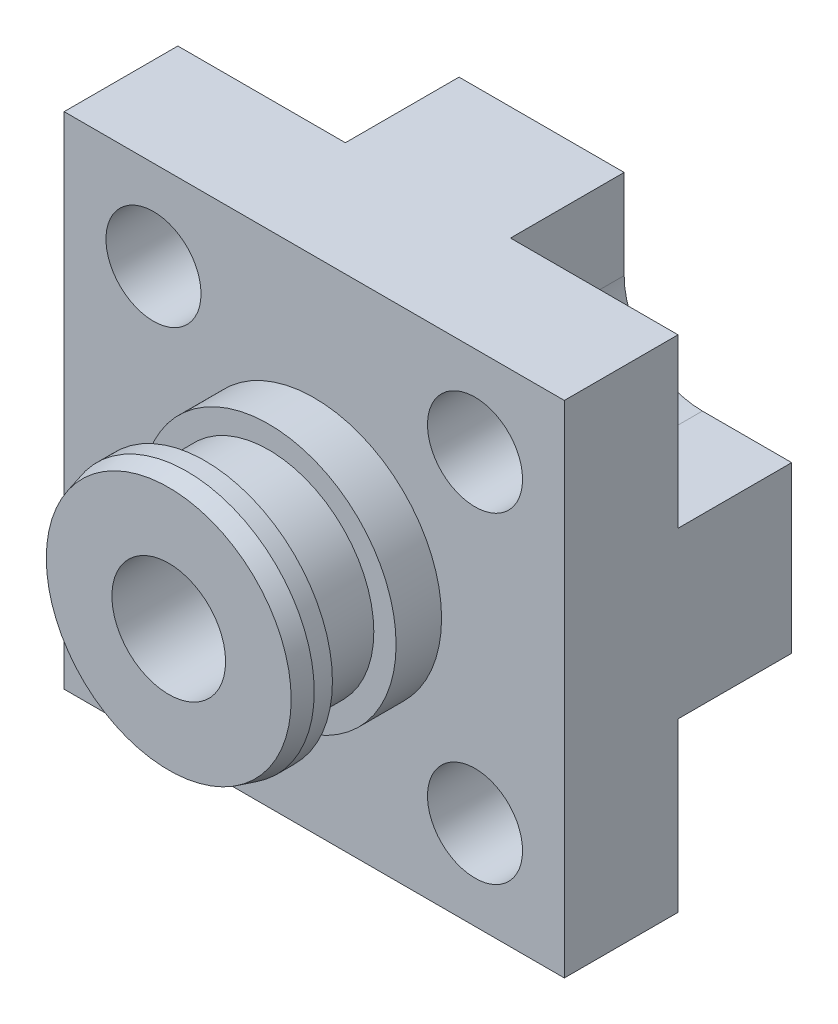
ISO-10303-21;
HEADER;
FILE_DESCRIPTION(('STEP AP214'),'2;1');
FILE_NAME('part.step','',(''),(''),'','','');
FILE_SCHEMA(('AUTOMOTIVE_DESIGN { 1 0 10303 214 1 1 1 1 }'));
ENDSEC;
DATA;
#1=APPLICATION_CONTEXT('core data for automotive mechanical design processes');
#2=APPLICATION_PROTOCOL_DEFINITION('international standard','automotive_design',2000,#1);
#3=PRODUCT_CONTEXT('',#1,'mechanical');
#4=PRODUCT('Part','Part','',(#3));
#5=PRODUCT_RELATED_PRODUCT_CATEGORY('part','',(#4));
#6=PRODUCT_DEFINITION_FORMATION('','',#4);
#7=PRODUCT_DEFINITION_CONTEXT('part definition',#1,'design');
#8=PRODUCT_DEFINITION('design','',#6,#7);
#9=PRODUCT_DEFINITION_SHAPE('','',#8);
#10=(LENGTH_UNIT() NAMED_UNIT(*) SI_UNIT(.MILLI.,.METRE.));
#11=(NAMED_UNIT(*) PLANE_ANGLE_UNIT() SI_UNIT($,.RADIAN.));
#12=(NAMED_UNIT(*) SI_UNIT($,.STERADIAN.) SOLID_ANGLE_UNIT());
#13=UNCERTAINTY_MEASURE_WITH_UNIT(LENGTH_MEASURE(1.E-05),#10,'distance_accuracy_value','');
#14=(GEOMETRIC_REPRESENTATION_CONTEXT(3) GLOBAL_UNCERTAINTY_ASSIGNED_CONTEXT((#13)) GLOBAL_UNIT_ASSIGNED_CONTEXT((#10,
#11,#12)) REPRESENTATION_CONTEXT('',''));
#15=CARTESIAN_POINT('',(0.,0.,0.));
#16=DIRECTION('',(0.,0.,1.));
#17=DIRECTION('',(1.,0.,0.));
#18=AXIS2_PLACEMENT_3D('',#15,#16,#17);
#19=CARTESIAN_POINT('',(8.98025612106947,-8.98025612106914,0.));
#20=DIRECTION('',(0.,0.,1.));
#21=DIRECTION('',(1.,0.,0.));
#22=AXIS2_PLACEMENT_3D('',#19,#20,#21);
#23=CYLINDRICAL_SURFACE('',#22,2.6543);
#24=CARTESIAN_POINT('',(8.98025612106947,-8.98025612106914,12.7));
#25=DIRECTION('',(0.,0.,1.));
#26=DIRECTION('',(1.,0.,0.));
#27=AXIS2_PLACEMENT_3D('',#24,#25,#26);
#28=CIRCLE('',#27,2.6543);
#29=CARTESIAN_POINT('',(11.6345561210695,-8.98025612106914,12.7));
#30=VERTEX_POINT('',#29);
#31=EDGE_CURVE('E321',#30,#30,#28,.T.);
#32=ORIENTED_EDGE('',*,*,#31,.T.);
#33=EDGE_LOOP('',(#32));
#34=FACE_BOUND('',#33,.T.);
#35=CARTESIAN_POINT('',(8.98025612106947,-8.98025612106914,6.35));
#36=DIRECTION('',(0.,0.,-1.));
#37=DIRECTION('',(-1.,0.,0.));
#38=AXIS2_PLACEMENT_3D('',#35,#36,#37);
#39=CIRCLE('',#38,2.6543);
#40=CARTESIAN_POINT('',(6.32595612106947,-8.98025612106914,6.35));
#41=VERTEX_POINT('',#40);
#42=EDGE_CURVE('E239',#41,#41,#39,.F.);
#43=ORIENTED_EDGE('',*,*,#42,.F.);
#44=EDGE_LOOP('',(#43));
#45=FACE_BOUND('',#44,.T.);
#46=ADVANCED_FACE('F34',(#34,#45),#23,.F.);
#47=CARTESIAN_POINT('',(-8.98025612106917,8.98025612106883,0.));
#48=DIRECTION('',(0.,0.,1.));
#49=DIRECTION('',(1.,0.,0.));
#50=AXIS2_PLACEMENT_3D('',#47,#48,#49);
#51=CYLINDRICAL_SURFACE('',#50,2.6543);
#52=CARTESIAN_POINT('',(-8.98025612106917,8.98025612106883,12.7));
#53=DIRECTION('',(0.,0.,1.));
#54=DIRECTION('',(1.,0.,0.));
#55=AXIS2_PLACEMENT_3D('',#52,#53,#54);
#56=CIRCLE('',#55,2.6543);
#57=CARTESIAN_POINT('',(-6.32595612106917,8.98025612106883,12.7));
#58=VERTEX_POINT('',#57);
#59=EDGE_CURVE('E315',#58,#58,#56,.T.);
#60=ORIENTED_EDGE('',*,*,#59,.T.);
#61=EDGE_LOOP('',(#60));
#62=FACE_BOUND('',#61,.T.);
#63=CARTESIAN_POINT('',(-8.98025612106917,8.98025612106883,6.35));
#64=DIRECTION('',(0.,0.,-1.));
#65=DIRECTION('',(-1.,0.,0.));
#66=AXIS2_PLACEMENT_3D('',#63,#64,#65);
#67=CIRCLE('',#66,2.6543);
#68=CARTESIAN_POINT('',(-11.6345561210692,8.98025612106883,6.35));
#69=VERTEX_POINT('',#68);
#70=EDGE_CURVE('E302',#69,#69,#67,.F.);
#71=ORIENTED_EDGE('',*,*,#70,.F.);
#72=EDGE_LOOP('',(#71));
#73=FACE_BOUND('',#72,.T.);
#74=ADVANCED_FACE('F409',(#62,#73),#51,.F.);
#75=CARTESIAN_POINT('',(0.,0.,15.24));
#76=DIRECTION('',(0.,0.,1.));
#77=DIRECTION('',(1.,0.,0.));
#78=AXIS2_PLACEMENT_3D('',#75,#76,#77);
#79=PLANE('',#78);
#80=CARTESIAN_POINT('',(0.,0.,15.24));
#81=DIRECTION('',(0.,0.,1.));
#82=DIRECTION('',(1.,0.,0.));
#83=AXIS2_PLACEMENT_3D('',#80,#81,#82);
#84=CIRCLE('',#83,7.112);
#85=CARTESIAN_POINT('',(7.112,0.,15.24));
#86=VERTEX_POINT('',#85);
#87=EDGE_CURVE('E346',#86,#86,#84,.T.);
#88=ORIENTED_EDGE('',*,*,#87,.T.);
#89=EDGE_LOOP('',(#88));
#90=FACE_BOUND('',#89,.T.);
#91=CARTESIAN_POINT('',(0.,0.,15.24));
#92=DIRECTION('',(0.,0.,1.));
#93=DIRECTION('',(1.,0.,0.));
#94=AXIS2_PLACEMENT_3D('',#91,#92,#93);
#95=CIRCLE('',#94,5.8674);
#96=CARTESIAN_POINT('',(5.8674,0.,15.24));
#97=VERTEX_POINT('',#96);
#98=EDGE_CURVE('E337',#97,#97,#95,.T.);
#99=ORIENTED_EDGE('',*,*,#98,.F.);
#100=EDGE_LOOP('',(#99));
#101=FACE_BOUND('',#100,.T.);
#102=ADVANCED_FACE('F415',(#90,#101),#79,.T.);
#103=CARTESIAN_POINT('',(13.97,-13.97,12.7));
#104=DIRECTION('',(0.,0.,1.));
#105=DIRECTION('',(1.,0.,0.));
#106=AXIS2_PLACEMENT_3D('',#103,#104,#105);
#107=PLANE('',#106);
#108=ORIENTED_EDGE('',*,*,#59,.F.);
#109=EDGE_LOOP('',(#108));
#110=FACE_BOUND('',#109,.T.);
#111=CARTESIAN_POINT('',(-8.98025612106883,-8.98025612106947,12.7));
#112=DIRECTION('',(0.,0.,1.));
#113=DIRECTION('',(1.,0.,0.));
#114=AXIS2_PLACEMENT_3D('',#111,#112,#113);
#115=CIRCLE('',#114,2.6543);
#116=CARTESIAN_POINT('',(-6.32595612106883,-8.98025612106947,12.7));
#117=VERTEX_POINT('',#116);
#118=EDGE_CURVE('E318',#117,#117,#115,.T.);
#119=ORIENTED_EDGE('',*,*,#118,.F.);
#120=EDGE_LOOP('',(#119));
#121=FACE_BOUND('',#120,.T.);
#122=ORIENTED_EDGE('',*,*,#31,.F.);
#123=EDGE_LOOP('',(#122));
#124=FACE_BOUND('',#123,.T.);
#125=CARTESIAN_POINT('',(8.98025612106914,8.98025612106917,12.7));
#126=DIRECTION('',(0.,0.,1.));
#127=DIRECTION('',(1.,0.,0.));
#128=AXIS2_PLACEMENT_3D('',#125,#126,#127);
#129=CIRCLE('',#128,2.6543);
#130=CARTESIAN_POINT('',(11.6345561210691,8.98025612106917,12.7));
#131=VERTEX_POINT('',#130);
#132=EDGE_CURVE('E324',#131,#131,#129,.T.);
#133=ORIENTED_EDGE('',*,*,#132,.F.);
#134=EDGE_LOOP('',(#133));
#135=FACE_BOUND('',#134,.T.);
#136=DIRECTION('',(0.,1.,0.));
#137=VECTOR('',#136,1.);
#138=CARTESIAN_POINT('',(13.97,13.97,12.7));
#139=LINE('',#138,#137);
#140=CARTESIAN_POINT('',(13.97,-13.97,12.7));
#141=VERTEX_POINT('',#140);
#142=CARTESIAN_POINT('',(13.97,13.97,12.7));
#143=VERTEX_POINT('',#142);
#144=EDGE_CURVE('E357',#141,#143,#139,.T.);
#145=ORIENTED_EDGE('',*,*,#144,.T.);
#146=DIRECTION('',(-1.,0.,0.));
#147=VECTOR('',#146,1.);
#148=CARTESIAN_POINT('',(-13.97,13.97,12.7));
#149=LINE('',#148,#147);
#150=CARTESIAN_POINT('',(-13.97,13.97,12.7));
#151=VERTEX_POINT('',#150);
#152=EDGE_CURVE('E360',#143,#151,#149,.T.);
#153=ORIENTED_EDGE('',*,*,#152,.T.);
#154=DIRECTION('',(0.,-1.,0.));
#155=VECTOR('',#154,1.);
#156=CARTESIAN_POINT('',(-13.97,13.97,12.7));
#157=LINE('',#156,#155);
#158=CARTESIAN_POINT('',(-13.97,-13.97,12.7));
#159=VERTEX_POINT('',#158);
#160=EDGE_CURVE('E362',#151,#159,#157,.T.);
#161=ORIENTED_EDGE('',*,*,#160,.T.);
#162=DIRECTION('',(1.,0.,0.));
#163=VECTOR('',#162,1.);
#164=CARTESIAN_POINT('',(-13.97,-13.97,12.7));
#165=LINE('',#164,#163);
#166=EDGE_CURVE('E364',#159,#141,#165,.T.);
#167=ORIENTED_EDGE('',*,*,#166,.T.);
#168=EDGE_LOOP('',(#145,#153,#161,#167));
#169=FACE_BOUND('',#168,.T.);
#170=CARTESIAN_POINT('',(0.,0.,12.7));
#171=DIRECTION('',(0.,0.,1.));
#172=DIRECTION('',(1.,0.,0.));
#173=AXIS2_PLACEMENT_3D('',#170,#171,#172);
#174=CIRCLE('',#173,7.112);
#175=CARTESIAN_POINT('',(7.112,0.,12.7));
#176=VERTEX_POINT('',#175);
#177=EDGE_CURVE('E343',#176,#176,#174,.T.);
#178=ORIENTED_EDGE('',*,*,#177,.F.);
#179=EDGE_LOOP('',(#178));
#180=FACE_BOUND('',#179,.T.);
#181=ADVANCED_FACE('F456',(#110,#121,#124,#135,#169,#180),#107,.T.);
#182=CARTESIAN_POINT('',(13.97,13.97,12.7));
#183=DIRECTION('',(-1.,0.,0.));
#184=DIRECTION('',(0.,0.,1.));
#185=AXIS2_PLACEMENT_3D('',#182,#183,#184);
#186=PLANE('',#185);
#187=DIRECTION('',(0.,-1.,0.));
#188=VECTOR('',#187,1.);
#189=CARTESIAN_POINT('',(13.97,13.97,6.35));
#190=LINE('',#189,#188);
#191=CARTESIAN_POINT('',(13.97,-4.61145612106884,6.35));
#192=VERTEX_POINT('',#191);
#193=CARTESIAN_POINT('',(13.97,-13.97,6.35));
#194=VERTEX_POINT('',#193);
#195=EDGE_CURVE('E243',#192,#194,#190,.T.);
#196=ORIENTED_EDGE('',*,*,#195,.F.);
#197=DIRECTION('',(0.,0.,-1.));
#198=VECTOR('',#197,1.);
#199=CARTESIAN_POINT('',(13.97,-4.61145612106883,12.7));
#200=LINE('',#199,#198);
#201=CARTESIAN_POINT('',(13.97,-4.61145612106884,0.));
#202=VERTEX_POINT('',#201);
#203=EDGE_CURVE('E245',#192,#202,#200,.T.);
#204=ORIENTED_EDGE('',*,*,#203,.T.);
#205=DIRECTION('',(0.,1.,0.));
#206=VECTOR('',#205,1.);
#207=CARTESIAN_POINT('',(13.97,13.97,0.));
#208=LINE('',#207,#206);
#209=CARTESIAN_POINT('',(13.97,4.61145612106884,0.));
#210=VERTEX_POINT('',#209);
#211=EDGE_CURVE('E349',#202,#210,#208,.T.);
#212=ORIENTED_EDGE('',*,*,#211,.T.);
#213=DIRECTION('',(0.,0.,1.));
#214=VECTOR('',#213,1.);
#215=CARTESIAN_POINT('',(13.97,4.61145612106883,12.7));
#216=LINE('',#215,#214);
#217=CARTESIAN_POINT('',(13.97,4.61145612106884,6.35));
#218=VERTEX_POINT('',#217);
#219=EDGE_CURVE('E281',#210,#218,#216,.T.);
#220=ORIENTED_EDGE('',*,*,#219,.T.);
#221=DIRECTION('',(0.,1.,0.));
#222=VECTOR('',#221,1.);
#223=CARTESIAN_POINT('',(13.97,13.97,6.35));
#224=LINE('',#223,#222);
#225=CARTESIAN_POINT('',(13.97,13.97,6.35));
#226=VERTEX_POINT('',#225);
#227=EDGE_CURVE('E275',#218,#226,#224,.T.);
#228=ORIENTED_EDGE('',*,*,#227,.T.);
#229=DIRECTION('',(0.,0.,-1.));
#230=VECTOR('',#229,1.);
#231=CARTESIAN_POINT('',(13.97,13.97,12.7));
#232=LINE('',#231,#230);
#233=EDGE_CURVE('E375',#143,#226,#232,.T.);
#234=ORIENTED_EDGE('',*,*,#233,.F.);
#235=ORIENTED_EDGE('',*,*,#144,.F.);
#236=DIRECTION('',(0.,0.,-1.));
#237=VECTOR('',#236,1.);
#238=CARTESIAN_POINT('',(13.97,-13.97,12.7));
#239=LINE('',#238,#237);
#240=EDGE_CURVE('E366',#141,#194,#239,.T.);
#241=ORIENTED_EDGE('',*,*,#240,.T.);
#242=EDGE_LOOP('',(#196,#204,#212,#220,#228,#234,#235,#241));
#243=FACE_BOUND('',#242,.T.);
#244=ADVANCED_FACE('F36',(#243),#186,.F.);
#245=CARTESIAN_POINT('',(-13.97,13.97,12.7));
#246=DIRECTION('',(0.,-1.,0.));
#247=DIRECTION('',(0.,0.,-1.));
#248=AXIS2_PLACEMENT_3D('',#245,#246,#247);
#249=PLANE('',#248);
#250=DIRECTION('',(-1.,0.,0.));
#251=VECTOR('',#250,1.);
#252=CARTESIAN_POINT('',(-13.97,13.97,6.35));
#253=LINE('',#252,#251);
#254=CARTESIAN_POINT('',(4.61145612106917,13.97,6.35));
#255=VERTEX_POINT('',#254);
#256=EDGE_CURVE('E272',#226,#255,#253,.T.);
#257=ORIENTED_EDGE('',*,*,#256,.T.);
#258=DIRECTION('',(0.,0.,-1.));
#259=VECTOR('',#258,1.);
#260=CARTESIAN_POINT('',(4.61145612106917,13.97,12.7));
#261=LINE('',#260,#259);
#262=CARTESIAN_POINT('',(4.61145612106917,13.97,0.));
#263=VERTEX_POINT('',#262);
#264=EDGE_CURVE('E278',#255,#263,#261,.T.);
#265=ORIENTED_EDGE('',*,*,#264,.T.);
#266=DIRECTION('',(-1.,0.,0.));
#267=VECTOR('',#266,1.);
#268=CARTESIAN_POINT('',(-13.97,13.97,0.));
#269=LINE('',#268,#267);
#270=CARTESIAN_POINT('',(-4.61145612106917,13.97,0.));
#271=VERTEX_POINT('',#270);
#272=EDGE_CURVE('E351',#263,#271,#269,.T.);
#273=ORIENTED_EDGE('',*,*,#272,.T.);
#274=DIRECTION('',(0.,0.,1.));
#275=VECTOR('',#274,1.);
#276=CARTESIAN_POINT('',(-4.61145612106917,13.97,12.7));
#277=LINE('',#276,#275);
#278=CARTESIAN_POINT('',(-4.61145612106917,13.97,6.35));
#279=VERTEX_POINT('',#278);
#280=EDGE_CURVE('E312',#271,#279,#277,.T.);
#281=ORIENTED_EDGE('',*,*,#280,.T.);
#282=DIRECTION('',(1.,0.,0.));
#283=VECTOR('',#282,1.);
#284=CARTESIAN_POINT('',(-13.97,13.97,6.35));
#285=LINE('',#284,#283);
#286=CARTESIAN_POINT('',(-13.97,13.97,6.35));
#287=VERTEX_POINT('',#286);
#288=EDGE_CURVE('E307',#287,#279,#285,.T.);
#289=ORIENTED_EDGE('',*,*,#288,.F.);
#290=DIRECTION('',(0.,0.,-1.));
#291=VECTOR('',#290,1.);
#292=CARTESIAN_POINT('',(-13.97,13.97,12.7));
#293=LINE('',#292,#291);
#294=EDGE_CURVE('E372',#151,#287,#293,.T.);
#295=ORIENTED_EDGE('',*,*,#294,.F.);
#296=ORIENTED_EDGE('',*,*,#152,.F.);
#297=ORIENTED_EDGE('',*,*,#233,.T.);
#298=EDGE_LOOP('',(#257,#265,#273,#281,#289,#295,#296,#297));
#299=FACE_BOUND('',#298,.T.);
#300=ADVANCED_FACE('F472',(#299),#249,.F.);
#301=CARTESIAN_POINT('',(-13.97,13.97,12.7));
#302=DIRECTION('',(1.,0.,0.));
#303=DIRECTION('',(0.,0.,-1.));
#304=AXIS2_PLACEMENT_3D('',#301,#302,#303);
#305=PLANE('',#304);
#306=DIRECTION('',(0.,-1.,0.));
#307=VECTOR('',#306,1.);
#308=CARTESIAN_POINT('',(-13.97,13.97,0.));
#309=LINE('',#308,#307);
#310=CARTESIAN_POINT('',(-13.97,4.61145612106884,0.));
#311=VERTEX_POINT('',#310);
#312=CARTESIAN_POINT('',(-13.97,-4.61145612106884,0.));
#313=VERTEX_POINT('',#312);
#314=EDGE_CURVE('E353',#311,#313,#309,.T.);
#315=ORIENTED_EDGE('',*,*,#314,.T.);
#316=DIRECTION('',(0.,0.,1.));
#317=VECTOR('',#316,1.);
#318=CARTESIAN_POINT('',(-13.97,-4.61145612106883,12.7));
#319=LINE('',#318,#317);
#320=CARTESIAN_POINT('',(-13.97,-4.61145612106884,6.35));
#321=VERTEX_POINT('',#320);
#322=EDGE_CURVE('E184',#313,#321,#319,.T.);
#323=ORIENTED_EDGE('',*,*,#322,.T.);
#324=DIRECTION('',(0.,-1.,0.));
#325=VECTOR('',#324,1.);
#326=CARTESIAN_POINT('',(-13.97,13.97,6.35));
#327=LINE('',#326,#325);
#328=CARTESIAN_POINT('',(-13.97,-13.97,6.35));
#329=VERTEX_POINT('',#328);
#330=EDGE_CURVE('E216',#321,#329,#327,.T.);
#331=ORIENTED_EDGE('',*,*,#330,.T.);
#332=DIRECTION('',(0.,0.,-1.));
#333=VECTOR('',#332,1.);
#334=CARTESIAN_POINT('',(-13.97,-13.97,12.7));
#335=LINE('',#334,#333);
#336=EDGE_CURVE('E369',#159,#329,#335,.T.);
#337=ORIENTED_EDGE('',*,*,#336,.F.);
#338=ORIENTED_EDGE('',*,*,#160,.F.);
#339=ORIENTED_EDGE('',*,*,#294,.T.);
#340=DIRECTION('',(0.,1.,0.));
#341=VECTOR('',#340,1.);
#342=CARTESIAN_POINT('',(-13.97,13.97,6.35));
#343=LINE('',#342,#341);
#344=CARTESIAN_POINT('',(-13.97,4.61145612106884,6.35));
#345=VERTEX_POINT('',#344);
#346=EDGE_CURVE('E305',#345,#287,#343,.T.);
#347=ORIENTED_EDGE('',*,*,#346,.F.);
#348=DIRECTION('',(0.,0.,-1.));
#349=VECTOR('',#348,1.);
#350=CARTESIAN_POINT('',(-13.97,4.61145612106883,12.7));
#351=LINE('',#350,#349);
#352=EDGE_CURVE('E309',#345,#311,#351,.T.);
#353=ORIENTED_EDGE('',*,*,#352,.T.);
#354=EDGE_LOOP('',(#315,#323,#331,#337,#338,#339,#347,#353));
#355=FACE_BOUND('',#354,.T.);
#356=ADVANCED_FACE('F469',(#355),#305,.F.);
#357=CARTESIAN_POINT('',(-13.97,-13.97,12.7));
#358=DIRECTION('',(0.,1.,0.));
#359=DIRECTION('',(0.,0.,1.));
#360=AXIS2_PLACEMENT_3D('',#357,#358,#359);
#361=PLANE('',#360);
#362=CARTESIAN_POINT('',(0.,-13.97,6.35));
#363=DIRECTION('',(0.,-1.,0.));
#364=DIRECTION('',(0.,0.,-1.));
#365=AXIS2_PLACEMENT_3D('',#362,#363,#364);
#366=CIRCLE('',#365,3.175);
#367=CARTESIAN_POINT('',(0.,-13.97,3.175));
#368=VERTEX_POINT('',#367);
#369=EDGE_CURVE('E327',#368,#368,#366,.T.);
#370=ORIENTED_EDGE('',*,*,#369,.F.);
#371=EDGE_LOOP('',(#370));
#372=FACE_BOUND('',#371,.T.);
#373=DIRECTION('',(1.,0.,0.));
#374=VECTOR('',#373,1.);
#375=CARTESIAN_POINT('',(-13.97,-13.97,6.35));
#376=LINE('',#375,#374);
#377=CARTESIAN_POINT('',(-4.61145612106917,-13.97,6.35));
#378=VERTEX_POINT('',#377);
#379=EDGE_CURVE('E213',#329,#378,#376,.T.);
#380=ORIENTED_EDGE('',*,*,#379,.T.);
#381=DIRECTION('',(0.,0.,-1.));
#382=VECTOR('',#381,1.);
#383=CARTESIAN_POINT('',(-4.61145612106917,-13.97,12.7));
#384=LINE('',#383,#382);
#385=CARTESIAN_POINT('',(-4.61145612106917,-13.97,0.));
#386=VERTEX_POINT('',#385);
#387=EDGE_CURVE('E219',#378,#386,#384,.T.);
#388=ORIENTED_EDGE('',*,*,#387,.T.);
#389=DIRECTION('',(1.,0.,0.));
#390=VECTOR('',#389,1.);
#391=CARTESIAN_POINT('',(-13.97,-13.97,0.));
#392=LINE('',#391,#390);
#393=CARTESIAN_POINT('',(4.61145612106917,-13.97,0.));
#394=VERTEX_POINT('',#393);
#395=EDGE_CURVE('E355',#386,#394,#392,.T.);
#396=ORIENTED_EDGE('',*,*,#395,.T.);
#397=DIRECTION('',(0.,0.,1.));
#398=VECTOR('',#397,1.);
#399=CARTESIAN_POINT('',(4.61145612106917,-13.97,12.7));
#400=LINE('',#399,#398);
#401=CARTESIAN_POINT('',(4.61145612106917,-13.97,6.35));
#402=VERTEX_POINT('',#401);
#403=EDGE_CURVE('E248',#394,#402,#400,.T.);
#404=ORIENTED_EDGE('',*,*,#403,.T.);
#405=DIRECTION('',(-1.,0.,0.));
#406=VECTOR('',#405,1.);
#407=CARTESIAN_POINT('',(-13.97,-13.97,6.35));
#408=LINE('',#407,#406);
#409=EDGE_CURVE('E241',#194,#402,#408,.T.);
#410=ORIENTED_EDGE('',*,*,#409,.F.);
#411=ORIENTED_EDGE('',*,*,#240,.F.);
#412=ORIENTED_EDGE('',*,*,#166,.F.);
#413=ORIENTED_EDGE('',*,*,#336,.T.);
#414=EDGE_LOOP('',(#380,#388,#396,#404,#410,#411,#412,#413));
#415=FACE_BOUND('',#414,.T.);
#416=ADVANCED_FACE('F463',(#372,#415),#361,.F.);
#417=CARTESIAN_POINT('',(13.97,-13.97,0.));
#418=DIRECTION('',(0.,0.,1.));
#419=DIRECTION('',(1.,0.,0.));
#420=AXIS2_PLACEMENT_3D('',#417,#418,#419);
#421=PLANE('',#420);
#422=CARTESIAN_POINT('',(-8.98025612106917,-8.98025612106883,0.));
#423=DIRECTION('',(0.,0.,-1.));
#424=DIRECTION('',(1.,0.,0.));
#425=AXIS2_PLACEMENT_3D('',#422,#423,#424);
#426=CIRCLE('',#425,4.3688);
#427=CARTESIAN_POINT('',(-8.98025612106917,-4.61145612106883,0.));
#428=VERTEX_POINT('',#427);
#429=CARTESIAN_POINT('',(-4.61145612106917,-8.98025612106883,0.));
#430=VERTEX_POINT('',#429);
#431=EDGE_CURVE('E54',#428,#430,#426,.T.);
#432=ORIENTED_EDGE('',*,*,#431,.F.);
#433=DIRECTION('',(1.,0.,0.));
#434=VECTOR('',#433,1.);
#435=CARTESIAN_POINT('',(-8.98025612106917,-4.61145612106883,0.));
#436=LINE('',#435,#434);
#437=EDGE_CURVE('E178',#313,#428,#436,.T.);
#438=ORIENTED_EDGE('',*,*,#437,.F.);
#439=ORIENTED_EDGE('',*,*,#314,.F.);
#440=DIRECTION('',(-1.,0.,0.));
#441=VECTOR('',#440,1.);
#442=CARTESIAN_POINT('',(-8.98025612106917,4.61145612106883,0.));
#443=LINE('',#442,#441);
#444=CARTESIAN_POINT('',(-8.98025612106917,4.61145612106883,0.));
#445=VERTEX_POINT('',#444);
#446=EDGE_CURVE('E286',#445,#311,#443,.T.);
#447=ORIENTED_EDGE('',*,*,#446,.F.);
#448=CARTESIAN_POINT('',(-8.98025612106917,8.98025612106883,0.));
#449=DIRECTION('',(0.,0.,-1.));
#450=DIRECTION('',(-1.,0.,0.));
#451=AXIS2_PLACEMENT_3D('',#448,#449,#450);
#452=CIRCLE('',#451,4.3688);
#453=CARTESIAN_POINT('',(-4.61145612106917,8.98025612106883,0.));
#454=VERTEX_POINT('',#453);
#455=EDGE_CURVE('E284',#454,#445,#452,.T.);
#456=ORIENTED_EDGE('',*,*,#455,.F.);
#457=DIRECTION('',(0.,-1.,0.));
#458=VECTOR('',#457,1.);
#459=CARTESIAN_POINT('',(-4.61145612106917,8.98025612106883,0.));
#460=LINE('',#459,#458);
#461=EDGE_CURVE('E288',#271,#454,#460,.T.);
#462=ORIENTED_EDGE('',*,*,#461,.F.);
#463=ORIENTED_EDGE('',*,*,#272,.F.);
#464=DIRECTION('',(0.,1.,0.));
#465=VECTOR('',#464,1.);
#466=CARTESIAN_POINT('',(4.61145612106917,8.98025612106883,0.));
#467=LINE('',#466,#465);
#468=CARTESIAN_POINT('',(4.61145612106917,8.98025612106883,0.));
#469=VERTEX_POINT('',#468);
#470=EDGE_CURVE('E253',#469,#263,#467,.T.);
#471=ORIENTED_EDGE('',*,*,#470,.F.);
#472=CARTESIAN_POINT('',(8.98025612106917,8.98025612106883,0.));
#473=DIRECTION('',(0.,0.,-1.));
#474=DIRECTION('',(1.,0.,0.));
#475=AXIS2_PLACEMENT_3D('',#472,#473,#474);
#476=CIRCLE('',#475,4.3688);
#477=CARTESIAN_POINT('',(8.98025612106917,4.61145612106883,0.));
#478=VERTEX_POINT('',#477);
#479=EDGE_CURVE('E251',#478,#469,#476,.T.);
#480=ORIENTED_EDGE('',*,*,#479,.F.);
#481=DIRECTION('',(-1.,0.,0.));
#482=VECTOR('',#481,1.);
#483=CARTESIAN_POINT('',(8.98025612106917,4.61145612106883,0.));
#484=LINE('',#483,#482);
#485=EDGE_CURVE('E255',#210,#478,#484,.T.);
#486=ORIENTED_EDGE('',*,*,#485,.F.);
#487=ORIENTED_EDGE('',*,*,#211,.F.);
#488=DIRECTION('',(1.,0.,0.));
#489=VECTOR('',#488,1.);
#490=CARTESIAN_POINT('',(8.98025612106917,-4.61145612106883,0.));
#491=LINE('',#490,#489);
#492=CARTESIAN_POINT('',(8.98025612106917,-4.61145612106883,0.));
#493=VERTEX_POINT('',#492);
#494=EDGE_CURVE('E224',#493,#202,#491,.T.);
#495=ORIENTED_EDGE('',*,*,#494,.F.);
#496=CARTESIAN_POINT('',(8.98025612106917,-8.98025612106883,0.));
#497=DIRECTION('',(0.,0.,-1.));
#498=DIRECTION('',(-1.,0.,0.));
#499=AXIS2_PLACEMENT_3D('',#496,#497,#498);
#500=CIRCLE('',#499,4.3688);
#501=CARTESIAN_POINT('',(4.61145612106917,-8.98025612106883,0.));
#502=VERTEX_POINT('',#501);
#503=EDGE_CURVE('E62',#502,#493,#500,.T.);
#504=ORIENTED_EDGE('',*,*,#503,.F.);
#505=DIRECTION('',(0.,1.,0.));
#506=VECTOR('',#505,1.);
#507=CARTESIAN_POINT('',(4.61145612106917,-8.98025612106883,0.));
#508=LINE('',#507,#506);
#509=EDGE_CURVE('E226',#394,#502,#508,.T.);
#510=ORIENTED_EDGE('',*,*,#509,.F.);
#511=ORIENTED_EDGE('',*,*,#395,.F.);
#512=DIRECTION('',(0.,-1.,0.));
#513=VECTOR('',#512,1.);
#514=CARTESIAN_POINT('',(-4.61145612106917,-8.98025612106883,0.));
#515=LINE('',#514,#513);
#516=EDGE_CURVE('E189',#430,#386,#515,.T.);
#517=ORIENTED_EDGE('',*,*,#516,.F.);
#518=EDGE_LOOP('',(#432,#438,#439,#447,#456,#462,#463,#471,#480,#486,#487,#495,#504,#510,#511,#517));
#519=FACE_BOUND('',#518,.T.);
#520=ADVANCED_FACE('F197',(#519),#421,.F.);
#521=CARTESIAN_POINT('',(0.,0.,15.24));
#522=DIRECTION('',(0.,0.,-1.));
#523=DIRECTION('',(-1.,0.,0.));
#524=AXIS2_PLACEMENT_3D('',#521,#522,#523);
#525=CYLINDRICAL_SURFACE('',#524,7.112);
#526=ORIENTED_EDGE('',*,*,#87,.F.);
#527=EDGE_LOOP('',(#526));
#528=FACE_BOUND('',#527,.T.);
#529=ORIENTED_EDGE('',*,*,#177,.T.);
#530=EDGE_LOOP('',(#529));
#531=FACE_BOUND('',#530,.T.);
#532=ADVANCED_FACE('F452',(#528,#531),#525,.T.);
#533=CARTESIAN_POINT('',(0.,0.,18.796));
#534=DIRECTION('',(0.,0.,-1.));
#535=DIRECTION('',(-1.,0.,0.));
#536=AXIS2_PLACEMENT_3D('',#533,#534,#535);
#537=CYLINDRICAL_SURFACE('',#536,5.8674);
#538=CARTESIAN_POINT('',(0.,0.,18.796));
#539=DIRECTION('',(0.,0.,1.));
#540=DIRECTION('',(1.,0.,0.));
#541=AXIS2_PLACEMENT_3D('',#538,#539,#540);
#542=CIRCLE('',#541,5.8674);
#543=CARTESIAN_POINT('',(5.8674,0.,18.796));
#544=VERTEX_POINT('',#543);
#545=EDGE_CURVE('E340',#544,#544,#542,.T.);
#546=ORIENTED_EDGE('',*,*,#545,.F.);
#547=EDGE_LOOP('',(#546));
#548=FACE_BOUND('',#547,.T.);
#549=ORIENTED_EDGE('',*,*,#98,.T.);
#550=EDGE_LOOP('',(#549));
#551=FACE_BOUND('',#550,.T.);
#552=ADVANCED_FACE('F442',(#548,#551),#537,.T.);
#553=CARTESIAN_POINT('',(0.,0.,18.796));
#554=DIRECTION('',(0.,0.,1.));
#555=DIRECTION('',(1.,0.,0.));
#556=AXIS2_PLACEMENT_3D('',#553,#554,#555);
#557=PLANE('',#556);
#558=CARTESIAN_POINT('',(0.,0.,18.796));
#559=DIRECTION('',(0.,0.,1.));
#560=DIRECTION('',(1.,0.,0.));
#561=AXIS2_PLACEMENT_3D('',#558,#559,#560);
#562=CIRCLE('',#561,7.112);
#563=CARTESIAN_POINT('',(7.112,0.,18.796));
#564=VERTEX_POINT('',#563);
#565=EDGE_CURVE('E334',#564,#564,#562,.T.);
#566=ORIENTED_EDGE('',*,*,#565,.F.);
#567=EDGE_LOOP('',(#566));
#568=FACE_BOUND('',#567,.T.);
#569=ORIENTED_EDGE('',*,*,#545,.T.);
#570=EDGE_LOOP('',(#569));
#571=FACE_BOUND('',#570,.T.);
#572=ADVANCED_FACE('F438',(#568,#571),#557,.F.);
#573=CARTESIAN_POINT('',(0.,0.,20.828));
#574=DIRECTION('',(0.,0.,-1.));
#575=DIRECTION('',(-1.,0.,0.));
#576=AXIS2_PLACEMENT_3D('',#573,#574,#575);
#577=CYLINDRICAL_SURFACE('',#576,7.112);
#578=CARTESIAN_POINT('',(0.,0.,19.812));
#579=DIRECTION('',(0.,0.,1.));
#580=DIRECTION('',(1.,0.,0.));
#581=AXIS2_PLACEMENT_3D('',#578,#579,#580);
#582=CIRCLE('',#581,7.112);
#583=CARTESIAN_POINT('',(7.112,0.,19.812));
#584=VERTEX_POINT('',#583);
#585=EDGE_CURVE('E11',#584,#584,#582,.F.);
#586=ORIENTED_EDGE('',*,*,#585,.T.);
#587=EDGE_LOOP('',(#586));
#588=FACE_BOUND('',#587,.T.);
#589=ORIENTED_EDGE('',*,*,#565,.T.);
#590=EDGE_LOOP('',(#589));
#591=FACE_BOUND('',#590,.T.);
#592=ADVANCED_FACE('F441',(#588,#591),#577,.T.);
#593=CARTESIAN_POINT('',(0.,0.,20.828));
#594=DIRECTION('',(0.,0.,1.));
#595=DIRECTION('',(1.,0.,0.));
#596=AXIS2_PLACEMENT_3D('',#593,#594,#595);
#597=PLANE('',#596);
#598=CARTESIAN_POINT('',(0.,0.,20.828));
#599=DIRECTION('',(0.,0.,1.));
#600=DIRECTION('',(1.,0.,0.));
#601=AXIS2_PLACEMENT_3D('',#598,#599,#600);
#602=CIRCLE('',#601,3.175);
#603=CARTESIAN_POINT('',(3.175,0.,20.828));
#604=VERTEX_POINT('',#603);
#605=EDGE_CURVE('E655',#604,#604,#602,.T.);
#606=ORIENTED_EDGE('',*,*,#605,.F.);
#607=EDGE_LOOP('',(#606));
#608=FACE_BOUND('',#607,.T.);
#609=CARTESIAN_POINT('',(0.,0.,20.828));
#610=DIRECTION('',(0.,0.,1.));
#611=DIRECTION('',(1.,0.,0.));
#612=AXIS2_PLACEMENT_3D('',#609,#610,#611);
#613=CIRCLE('',#612,6.83976362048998);
#614=CARTESIAN_POINT('',(6.83976362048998,0.,20.828));
#615=VERTEX_POINT('',#614);
#616=EDGE_CURVE('E47',#615,#615,#613,.T.);
#617=ORIENTED_EDGE('',*,*,#616,.T.);
#618=EDGE_LOOP('',(#617));
#619=FACE_BOUND('',#618,.T.);
#620=ADVANCED_FACE('F391',(#608,#619),#597,.T.);
#621=CARTESIAN_POINT('',(0.,-7.62,6.35));
#622=DIRECTION('',(0.,-1.,0.));
#623=DIRECTION('',(0.,0.,-1.));
#624=AXIS2_PLACEMENT_3D('',#621,#622,#623);
#625=PLANE('',#624);
#626=CARTESIAN_POINT('',(0.,-7.62,6.35));
#627=DIRECTION('',(0.,-1.,0.));
#628=DIRECTION('',(0.,0.,-1.));
#629=AXIS2_PLACEMENT_3D('',#626,#627,#628);
#630=CIRCLE('',#629,3.175);
#631=CARTESIAN_POINT('',(0.,-7.62,3.175));
#632=VERTEX_POINT('',#631);
#633=EDGE_CURVE('E330',#632,#632,#630,.T.);
#634=ORIENTED_EDGE('',*,*,#633,.T.);
#635=EDGE_LOOP('',(#634));
#636=FACE_BOUND('',#635,.T.);
#637=CARTESIAN_POINT('',(0.,-7.62,6.35));
#638=DIRECTION('',(0.,-1.,0.));
#639=DIRECTION('',(0.,0.,-1.));
#640=AXIS2_PLACEMENT_3D('',#637,#638,#639);
#641=CIRCLE('',#640,2.38125);
#642=CARTESIAN_POINT('',(0.,-7.62,3.96875));
#643=VERTEX_POINT('',#642);
#644=EDGE_CURVE('E333',#643,#643,#641,.F.);
#645=ORIENTED_EDGE('',*,*,#644,.T.);
#646=EDGE_LOOP('',(#645));
#647=FACE_BOUND('',#646,.T.);
#648=ADVANCED_FACE('F427',(#636,#647),#625,.T.);
#649=CARTESIAN_POINT('',(0.,-7.62,6.35));
#650=DIRECTION('',(0.,-1.,0.));
#651=DIRECTION('',(0.,0.,-1.));
#652=AXIS2_PLACEMENT_3D('',#649,#650,#651);
#653=CYLINDRICAL_SURFACE('',#652,3.175);
#654=ORIENTED_EDGE('',*,*,#633,.F.);
#655=EDGE_LOOP('',(#654));
#656=FACE_BOUND('',#655,.T.);
#657=ORIENTED_EDGE('',*,*,#369,.T.);
#658=EDGE_LOOP('',(#657));
#659=FACE_BOUND('',#658,.T.);
#660=ADVANCED_FACE('F430',(#656,#659),#653,.F.);
#661=CARTESIAN_POINT('',(0.,1.27,6.35));
#662=DIRECTION('',(0.,-1.,0.));
#663=DIRECTION('',(0.,0.,-1.));
#664=AXIS2_PLACEMENT_3D('',#661,#662,#663);
#665=CYLINDRICAL_SURFACE('',#664,2.38125);
#666=CARTESIAN_POINT('',(0.,-3.175,3.96875));
#667=CARTESIAN_POINT('',(-0.11623774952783,-3.17499261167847,3.96875771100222));
#668=CARTESIAN_POINT('',(-0.23266564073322,-3.16854909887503,3.97733050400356));
#669=CARTESIAN_POINT('',(-0.461861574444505,-3.14335491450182,4.01108393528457));
#670=CARTESIAN_POINT('',(-0.57461966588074,-3.12457330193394,4.03630632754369));
#671=CARTESIAN_POINT('',(-0.792534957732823,-3.07650633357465,4.10164425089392));
#672=CARTESIAN_POINT('',(-0.897733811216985,-3.04728486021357,4.14166925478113));
#673=CARTESIAN_POINT('',(-1.0992204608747,-2.98054008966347,4.23472346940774));
#674=CARTESIAN_POINT('',(-1.19551085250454,-2.94301922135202,4.28774887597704));
#675=CARTESIAN_POINT('',(-1.38662717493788,-2.8582865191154,4.41049253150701));
#676=CARTESIAN_POINT('',(-1.48049175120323,-2.81049902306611,4.48130188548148));
#677=CARTESIAN_POINT('',(-1.65580562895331,-2.7109264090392,4.63469964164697));
#678=CARTESIAN_POINT('',(-1.737235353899,-2.65913517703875,4.71730622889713));
#679=CARTESIAN_POINT('',(-1.90241493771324,-2.54430408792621,4.91106293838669));
#680=CARTESIAN_POINT('',(-1.98327293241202,-2.48111732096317,5.02460208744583));
#681=CARTESIAN_POINT('',(-2.12505922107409,-2.3607941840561,5.26645348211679));
#682=CARTESIAN_POINT('',(-2.18601475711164,-2.30364961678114,5.39474520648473));
#683=CARTESIAN_POINT('',(-2.26822996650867,-2.2221373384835,5.61896075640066));
#684=CARTESIAN_POINT('',(-2.29593258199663,-2.1932543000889,5.71085773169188));
#685=CARTESIAN_POINT('',(-2.34030317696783,-2.14584905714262,5.89977346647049));
#686=CARTESIAN_POINT('',(-2.35699641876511,-2.12730314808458,5.99677994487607));
#687=CARTESIAN_POINT('',(-2.3782785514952,-2.10349718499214,6.19471485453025));
#688=CARTESIAN_POINT('',(-2.38275740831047,-2.09835792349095,6.29567068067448));
#689=CARTESIAN_POINT('',(-2.37884038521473,-2.10279506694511,6.49702617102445));
#690=CARTESIAN_POINT('',(-2.37043988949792,-2.11237674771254,6.59742562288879));
#691=CARTESIAN_POINT('',(-2.34311411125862,-2.14261101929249,6.78369126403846));
#692=CARTESIAN_POINT('',(-2.32540947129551,-2.1619711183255,6.86996398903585));
#693=CARTESIAN_POINT('',(-2.28132752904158,-2.20843781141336,7.03808421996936));
#694=CARTESIAN_POINT('',(-2.25494189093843,-2.23555184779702,7.11992738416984));
#695=CARTESIAN_POINT('',(-2.17539989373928,-2.3136505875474,7.3283070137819));
#696=CARTESIAN_POINT('',(-2.11582235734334,-2.36895718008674,7.45077316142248));
#697=CARTESIAN_POINT('',(-1.97831112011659,-2.48496610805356,7.68222448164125));
#698=CARTESIAN_POINT('',(-1.90033281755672,-2.54568132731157,7.7911759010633));
#699=CARTESIAN_POINT('',(-1.72484421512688,-2.66782029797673,7.99743350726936));
#700=CARTESIAN_POINT('',(-1.62689183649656,-2.72922343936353,8.09437771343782));
#701=CARTESIAN_POINT('',(-1.41354575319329,-2.845562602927,8.27129353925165));
#702=CARTESIAN_POINT('',(-1.29818614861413,-2.90051090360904,8.35129762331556));
#703=CARTESIAN_POINT('',(-1.07616955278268,-2.98894065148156,8.47721951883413));
#704=CARTESIAN_POINT('',(-0.972407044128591,-3.02451723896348,8.52675554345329));
#705=CARTESIAN_POINT('',(-0.756209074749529,-3.0856698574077,8.61095699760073));
#706=CARTESIAN_POINT('',(-0.643779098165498,-3.11125215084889,8.64563174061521));
#707=CARTESIAN_POINT('',(-0.412236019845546,-3.1503237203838,8.6983147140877));
#708=CARTESIAN_POINT('',(-0.293086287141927,-3.1637381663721,8.71621983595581));
#709=CARTESIAN_POINT('',(-0.052706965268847,-3.17683965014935,8.73370998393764));
#710=CARTESIAN_POINT('',(0.0685217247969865,-3.1765324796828,8.73330273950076));
#711=CARTESIAN_POINT('',(0.296551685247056,-3.16297544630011,8.71519900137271));
#712=CARTESIAN_POINT('',(0.403577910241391,-3.15103015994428,8.69924517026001));
#713=CARTESIAN_POINT('',(0.612950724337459,-3.11707717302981,8.65350410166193));
#714=CARTESIAN_POINT('',(0.715296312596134,-3.09506733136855,8.62371392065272));
#715=CARTESIAN_POINT('',(0.916649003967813,-3.04164744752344,8.55045363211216));
#716=CARTESIAN_POINT('',(1.01541080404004,-3.00993306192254,8.50653782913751));
#717=CARTESIAN_POINT('',(1.20414866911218,-2.93952537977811,8.40712589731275));
#718=CARTESIAN_POINT('',(1.29412351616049,-2.90083111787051,8.3516281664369));
#719=CARTESIAN_POINT('',(1.47877249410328,-2.81176869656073,8.22042053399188));
#720=CARTESIAN_POINT('',(1.57172208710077,-2.76053014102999,8.14288297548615));
#721=CARTESIAN_POINT('',(1.74422651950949,-2.65490934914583,7.97558031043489));
#722=CARTESIAN_POINT('',(1.82375080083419,-2.60052030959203,7.88578812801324));
#723=CARTESIAN_POINT('',(1.93931985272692,-2.5144701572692,7.7336413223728));
#724=CARTESIAN_POINT('',(1.97993958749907,-2.48251547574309,7.67488157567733));
#725=CARTESIAN_POINT('',(2.05600916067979,-2.41989390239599,7.55346253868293));
#726=CARTESIAN_POINT('',(2.09145709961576,-2.38922748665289,7.49080182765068));
#727=CARTESIAN_POINT('',(2.18948788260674,-2.30096008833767,7.29727485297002));
#728=CARTESIAN_POINT('',(2.24411276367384,-2.24681203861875,7.16040141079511));
#729=CARTESIAN_POINT('',(2.31165527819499,-2.17675862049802,6.92876578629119));
#730=CARTESIAN_POINT('',(2.33253124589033,-2.15417005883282,6.83832539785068));
#731=CARTESIAN_POINT('',(2.36365144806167,-2.11998109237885,6.65368124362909));
#732=CARTESIAN_POINT('',(2.37391941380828,-2.10835616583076,6.55948636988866));
#733=CARTESIAN_POINT('',(2.38308109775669,-2.09800167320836,6.36932033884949));
#734=CARTESIAN_POINT('',(2.38191707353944,-2.09933757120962,6.2733426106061));
#735=CARTESIAN_POINT('',(2.36818295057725,-2.11481118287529,6.08321004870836));
#736=CARTESIAN_POINT('',(2.35559813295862,-2.12896541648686,5.98905772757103));
#737=CARTESIAN_POINT('',(2.31606465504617,-2.1719754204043,5.7849854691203));
#738=CARTESIAN_POINT('',(2.28658002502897,-2.20336608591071,5.67611048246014));
#739=CARTESIAN_POINT('',(2.21408082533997,-2.2762044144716,5.46650117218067));
#740=CARTESIAN_POINT('',(2.17103207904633,-2.31767742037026,5.36578822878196));
#741=CARTESIAN_POINT('',(2.05579279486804,-2.42119976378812,5.13949738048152));
#742=CARTESIAN_POINT('',(1.97867343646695,-2.48539621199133,5.01741343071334));
#743=CARTESIAN_POINT('',(1.8042162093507,-2.61482398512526,4.78929221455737));
#744=CARTESIAN_POINT('',(1.70686032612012,-2.68005618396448,4.68326939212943));
#745=CARTESIAN_POINT('',(1.49161606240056,-2.80558406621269,4.48811116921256));
#746=CARTESIAN_POINT('',(1.37356516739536,-2.86583466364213,4.39912205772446));
#747=CARTESIAN_POINT('',(1.18291154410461,-2.94722537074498,4.28199768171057));
#748=CARTESIAN_POINT('',(1.11712731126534,-2.9728493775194,4.24569434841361));
#749=CARTESIAN_POINT('',(0.981351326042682,-3.02038742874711,4.17905201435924));
#750=CARTESIAN_POINT('',(0.911361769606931,-3.04230338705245,4.14870993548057));
#751=CARTESIAN_POINT('',(0.737978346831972,-3.08983427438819,4.08339571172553));
#752=CARTESIAN_POINT('',(0.632715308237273,-3.11324533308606,4.05167735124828));
#753=CARTESIAN_POINT('',(0.417249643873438,-3.14934789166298,4.00300456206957));
#754=CARTESIAN_POINT('',(0.307061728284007,-3.16206932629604,3.98600890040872));
#755=CARTESIAN_POINT('',(0.163454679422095,-3.17095913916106,3.97414030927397));
#756=CARTESIAN_POINT('',(0.130821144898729,-3.17247202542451,3.97212148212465));
#757=CARTESIAN_POINT('',(0.0654634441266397,-3.17449357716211,3.96942513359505));
#758=CARTESIAN_POINT('',(0.0327392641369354,-3.17500208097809,3.96874782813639));
#759=CARTESIAN_POINT('',(0.,-3.175,3.96875));
#760=B_SPLINE_CURVE_WITH_KNOTS('',3,(#666,#667,#668,#669,#670,#671,#672,#673,#674,#675,#676,
#677,#678,#679,#680,#681,#682,#683,#684,#685,#686,#687,#688,#689,#690,#691,#692,#693,#694,#695,
#696,#697,#698,#699,#700,#701,#702,#703,#704,#705,#706,#707,#708,#709,#710,#711,#712,#713,#714,
#715,#716,#717,#718,#719,#720,#721,#722,#723,#724,#725,#726,#727,#728,#729,#730,#731,#732,#733,
#734,#735,#736,#737,#738,#739,#740,#741,#742,#743,#744,#745,#746,#747,#748,#749,#750,#751,#752,
#753,#754,#755,#756,#757,#758,#759),.UNSPECIFIED.,.T.,.F.,(4,2,2,2,2,2,2,2,2,2,2,2,2,2,2,2,2,2,
2,2,2,2,2,2,2,2,2,2,2,2,2,2,2,2,2,2,2,2,2,2,2,2,2,2,2,2,4),(0.,0.348570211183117,
0.698017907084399,1.04536292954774,1.39260643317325,1.7720060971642,2.15199703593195,
2.60921525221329,3.06580498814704,3.36549235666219,3.66448964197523,3.96617170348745,
4.26796190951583,4.537501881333,4.80730143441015,5.24588314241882,5.68553905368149,
6.13625715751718,6.58610351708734,6.94573326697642,7.30513730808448,7.66673692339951,
8.02818391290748,8.3532850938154,8.67845546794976,9.01510197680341,9.35179508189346,
9.74471606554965,10.138519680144,10.3730162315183,10.6075986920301,11.0748475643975,
11.360400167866,11.645312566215,11.931664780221,12.2183865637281,12.5677020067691,
12.9179047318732,13.3895916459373,13.8617002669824,14.3376974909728,14.5755004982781,
14.8131803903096,15.1489124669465,15.4837012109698,15.5818629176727,15.6800404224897),.UNSPECIFIED.);
#761=CARTESIAN_POINT('',(0.,-3.175,3.96875));
#762=VERTEX_POINT('',#761);
#763=EDGE_CURVE('E38',#762,#762,#760,.T.);
#764=ORIENTED_EDGE('',*,*,#763,.T.);
#765=EDGE_LOOP('',(#764));
#766=FACE_BOUND('',#765,.T.);
#767=ORIENTED_EDGE('',*,*,#644,.F.);
#768=EDGE_LOOP('',(#767));
#769=FACE_BOUND('',#768,.T.);
#770=ADVANCED_FACE('F425',(#766,#769),#665,.F.);
#771=CARTESIAN_POINT('',(8.98025612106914,8.98025612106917,0.));
#772=DIRECTION('',(0.,0.,1.));
#773=DIRECTION('',(1.,0.,0.));
#774=AXIS2_PLACEMENT_3D('',#771,#772,#773);
#775=CYLINDRICAL_SURFACE('',#774,2.6543);
#776=CARTESIAN_POINT('',(8.98025612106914,8.98025612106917,6.35));
#777=DIRECTION('',(0.,0.,1.));
#778=DIRECTION('',(1.,0.,0.));
#779=AXIS2_PLACEMENT_3D('',#776,#777,#778);
#780=CIRCLE('',#779,2.6543);
#781=CARTESIAN_POINT('',(11.6345561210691,8.98025612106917,6.35));
#782=VERTEX_POINT('',#781);
#783=EDGE_CURVE('E269',#782,#782,#780,.F.);
#784=ORIENTED_EDGE('',*,*,#783,.T.);
#785=EDGE_LOOP('',(#784));
#786=FACE_BOUND('',#785,.T.);
#787=ORIENTED_EDGE('',*,*,#132,.T.);
#788=EDGE_LOOP('',(#787));
#789=FACE_BOUND('',#788,.T.);
#790=ADVANCED_FACE('F422',(#786,#789),#775,.F.);
#791=CARTESIAN_POINT('',(-8.98025612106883,-8.98025612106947,0.));
#792=DIRECTION('',(0.,0.,1.));
#793=DIRECTION('',(1.,0.,0.));
#794=AXIS2_PLACEMENT_3D('',#791,#792,#793);
#795=CYLINDRICAL_SURFACE('',#794,2.6543);
#796=CARTESIAN_POINT('',(-8.98025612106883,-8.98025612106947,6.35));
#797=DIRECTION('',(0.,0.,1.));
#798=DIRECTION('',(1.,0.,0.));
#799=AXIS2_PLACEMENT_3D('',#796,#797,#798);
#800=CIRCLE('',#799,2.6543);
#801=CARTESIAN_POINT('',(-6.32595612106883,-8.98025612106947,6.35));
#802=VERTEX_POINT('',#801);
#803=EDGE_CURVE('E193',#802,#802,#800,.F.);
#804=ORIENTED_EDGE('',*,*,#803,.T.);
#805=EDGE_LOOP('',(#804));
#806=FACE_BOUND('',#805,.T.);
#807=ORIENTED_EDGE('',*,*,#118,.T.);
#808=EDGE_LOOP('',(#807));
#809=FACE_BOUND('',#808,.T.);
#810=ADVANCED_FACE('F421',(#806,#809),#795,.F.);
#811=CARTESIAN_POINT('',(-4.61145612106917,8.98025612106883,6.35));
#812=DIRECTION('',(1.,0.,0.));
#813=DIRECTION('',(0.,1.,0.));
#814=AXIS2_PLACEMENT_3D('',#811,#812,#813);
#815=PLANE('',#814);
#816=ORIENTED_EDGE('',*,*,#461,.T.);
#817=DIRECTION('',(0.,0.,-1.));
#818=VECTOR('',#817,1.);
#819=CARTESIAN_POINT('',(-4.61145612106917,8.98025612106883,6.35));
#820=LINE('',#819,#818);
#821=CARTESIAN_POINT('',(-4.61145612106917,8.98025612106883,6.35));
#822=VERTEX_POINT('',#821);
#823=EDGE_CURVE('E299',#822,#454,#820,.T.);
#824=ORIENTED_EDGE('',*,*,#823,.F.);
#825=DIRECTION('',(0.,-1.,0.));
#826=VECTOR('',#825,1.);
#827=CARTESIAN_POINT('',(-4.61145612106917,8.98025612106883,6.35));
#828=LINE('',#827,#826);
#829=EDGE_CURVE('E296',#279,#822,#828,.T.);
#830=ORIENTED_EDGE('',*,*,#829,.F.);
#831=ORIENTED_EDGE('',*,*,#280,.F.);
#832=EDGE_LOOP('',(#816,#824,#830,#831));
#833=FACE_BOUND('',#832,.T.);
#834=ADVANCED_FACE('F521',(#833),#815,.F.);
#835=CARTESIAN_POINT('',(-8.98025612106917,4.61145612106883,6.35));
#836=DIRECTION('',(0.,-1.,0.));
#837=DIRECTION('',(1.,0.,0.));
#838=AXIS2_PLACEMENT_3D('',#835,#836,#837);
#839=PLANE('',#838);
#840=DIRECTION('',(-1.,0.,0.));
#841=VECTOR('',#840,1.);
#842=CARTESIAN_POINT('',(-8.98025612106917,4.61145612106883,6.35));
#843=LINE('',#842,#841);
#844=CARTESIAN_POINT('',(-8.98025612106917,4.61145612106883,6.35));
#845=VERTEX_POINT('',#844);
#846=EDGE_CURVE('E293',#845,#345,#843,.T.);
#847=ORIENTED_EDGE('',*,*,#846,.F.);
#848=DIRECTION('',(0.,0.,-1.));
#849=VECTOR('',#848,1.);
#850=CARTESIAN_POINT('',(-8.98025612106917,4.61145612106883,6.35));
#851=LINE('',#850,#849);
#852=EDGE_CURVE('E298',#845,#445,#851,.T.);
#853=ORIENTED_EDGE('',*,*,#852,.T.);
#854=ORIENTED_EDGE('',*,*,#446,.T.);
#855=ORIENTED_EDGE('',*,*,#352,.F.);
#856=EDGE_LOOP('',(#847,#853,#854,#855));
#857=FACE_BOUND('',#856,.T.);
#858=ADVANCED_FACE('F519',(#857),#839,.F.);
#859=CARTESIAN_POINT('',(-8.98025612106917,8.98025612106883,6.35));
#860=DIRECTION('',(0.,0.,-1.));
#861=DIRECTION('',(-1.,0.,0.));
#862=AXIS2_PLACEMENT_3D('',#859,#860,#861);
#863=PLANE('',#862);
#864=ORIENTED_EDGE('',*,*,#70,.T.);
#865=EDGE_LOOP('',(#864));
#866=FACE_BOUND('',#865,.T.);
#867=ORIENTED_EDGE('',*,*,#288,.T.);
#868=ORIENTED_EDGE('',*,*,#829,.T.);
#869=CARTESIAN_POINT('',(-8.98025612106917,8.98025612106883,6.35));
#870=DIRECTION('',(0.,0.,-1.));
#871=DIRECTION('',(-1.,0.,0.));
#872=AXIS2_PLACEMENT_3D('',#869,#870,#871);
#873=CIRCLE('',#872,4.3688);
#874=EDGE_CURVE('E290',#822,#845,#873,.T.);
#875=ORIENTED_EDGE('',*,*,#874,.T.);
#876=ORIENTED_EDGE('',*,*,#846,.T.);
#877=ORIENTED_EDGE('',*,*,#346,.T.);
#878=EDGE_LOOP('',(#867,#868,#875,#876,#877));
#879=FACE_BOUND('',#878,.T.);
#880=ADVANCED_FACE('F516',(#866,#879),#863,.T.);
#881=CARTESIAN_POINT('',(-8.98025612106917,8.98025612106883,6.35));
#882=DIRECTION('',(0.,0.,-1.));
#883=DIRECTION('',(-1.,0.,0.));
#884=AXIS2_PLACEMENT_3D('',#881,#882,#883);
#885=CYLINDRICAL_SURFACE('',#884,4.3688);
#886=ORIENTED_EDGE('',*,*,#455,.T.);
#887=ORIENTED_EDGE('',*,*,#852,.F.);
#888=ORIENTED_EDGE('',*,*,#874,.F.);
#889=ORIENTED_EDGE('',*,*,#823,.T.);
#890=EDGE_LOOP('',(#886,#887,#888,#889));
#891=FACE_BOUND('',#890,.T.);
#892=ADVANCED_FACE('F510',(#891),#885,.F.);
#893=CARTESIAN_POINT('',(8.98025612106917,4.61145612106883,6.35));
#894=DIRECTION('',(0.,-1.,0.));
#895=DIRECTION('',(1.,0.,0.));
#896=AXIS2_PLACEMENT_3D('',#893,#894,#895);
#897=PLANE('',#896);
#898=ORIENTED_EDGE('',*,*,#485,.T.);
#899=DIRECTION('',(0.,0.,-1.));
#900=VECTOR('',#899,1.);
#901=CARTESIAN_POINT('',(8.98025612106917,4.61145612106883,6.35));
#902=LINE('',#901,#900);
#903=CARTESIAN_POINT('',(8.98025612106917,4.61145612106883,6.35));
#904=VERTEX_POINT('',#903);
#905=EDGE_CURVE('E266',#904,#478,#902,.T.);
#906=ORIENTED_EDGE('',*,*,#905,.F.);
#907=DIRECTION('',(-1.,0.,0.));
#908=VECTOR('',#907,1.);
#909=CARTESIAN_POINT('',(8.98025612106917,4.61145612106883,6.35));
#910=LINE('',#909,#908);
#911=EDGE_CURVE('E263',#218,#904,#910,.T.);
#912=ORIENTED_EDGE('',*,*,#911,.F.);
#913=ORIENTED_EDGE('',*,*,#219,.F.);
#914=EDGE_LOOP('',(#898,#906,#912,#913));
#915=FACE_BOUND('',#914,.T.);
#916=ADVANCED_FACE('F492',(#915),#897,.F.);
#917=CARTESIAN_POINT('',(4.61145612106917,8.98025612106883,6.35));
#918=DIRECTION('',(-1.,0.,0.));
#919=DIRECTION('',(0.,-1.,0.));
#920=AXIS2_PLACEMENT_3D('',#917,#918,#919);
#921=PLANE('',#920);
#922=DIRECTION('',(0.,1.,0.));
#923=VECTOR('',#922,1.);
#924=CARTESIAN_POINT('',(4.61145612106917,8.98025612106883,6.35));
#925=LINE('',#924,#923);
#926=CARTESIAN_POINT('',(4.61145612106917,8.98025612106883,6.35));
#927=VERTEX_POINT('',#926);
#928=EDGE_CURVE('E260',#927,#255,#925,.T.);
#929=ORIENTED_EDGE('',*,*,#928,.F.);
#930=DIRECTION('',(0.,0.,-1.));
#931=VECTOR('',#930,1.);
#932=CARTESIAN_POINT('',(4.61145612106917,8.98025612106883,6.35));
#933=LINE('',#932,#931);
#934=EDGE_CURVE('E265',#927,#469,#933,.T.);
#935=ORIENTED_EDGE('',*,*,#934,.T.);
#936=ORIENTED_EDGE('',*,*,#470,.T.);
#937=ORIENTED_EDGE('',*,*,#264,.F.);
#938=EDGE_LOOP('',(#929,#935,#936,#937));
#939=FACE_BOUND('',#938,.T.);
#940=ADVANCED_FACE('F501',(#939),#921,.F.);
#941=CARTESIAN_POINT('',(8.98025612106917,8.98025612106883,6.35));
#942=DIRECTION('',(0.,0.,1.));
#943=DIRECTION('',(1.,0.,0.));
#944=AXIS2_PLACEMENT_3D('',#941,#942,#943);
#945=PLANE('',#944);
#946=ORIENTED_EDGE('',*,*,#783,.F.);
#947=EDGE_LOOP('',(#946));
#948=FACE_BOUND('',#947,.T.);
#949=ORIENTED_EDGE('',*,*,#911,.T.);
#950=CARTESIAN_POINT('',(8.98025612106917,8.98025612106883,6.35));
#951=DIRECTION('',(0.,0.,-1.));
#952=DIRECTION('',(1.,0.,0.));
#953=AXIS2_PLACEMENT_3D('',#950,#951,#952);
#954=CIRCLE('',#953,4.3688);
#955=EDGE_CURVE('E257',#904,#927,#954,.T.);
#956=ORIENTED_EDGE('',*,*,#955,.T.);
#957=ORIENTED_EDGE('',*,*,#928,.T.);
#958=ORIENTED_EDGE('',*,*,#256,.F.);
#959=ORIENTED_EDGE('',*,*,#227,.F.);
#960=EDGE_LOOP('',(#949,#956,#957,#958,#959));
#961=FACE_BOUND('',#960,.T.);
#962=ADVANCED_FACE('F483',(#948,#961),#945,.F.);
#963=CARTESIAN_POINT('',(8.98025612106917,8.98025612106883,6.35));
#964=DIRECTION('',(0.,0.,-1.));
#965=DIRECTION('',(-1.,0.,0.));
#966=AXIS2_PLACEMENT_3D('',#963,#964,#965);
#967=CYLINDRICAL_SURFACE('',#966,4.3688);
#968=ORIENTED_EDGE('',*,*,#479,.T.);
#969=ORIENTED_EDGE('',*,*,#934,.F.);
#970=ORIENTED_EDGE('',*,*,#955,.F.);
#971=ORIENTED_EDGE('',*,*,#905,.T.);
#972=EDGE_LOOP('',(#968,#969,#970,#971));
#973=FACE_BOUND('',#972,.T.);
#974=ADVANCED_FACE('F498',(#973),#967,.F.);
#975=CARTESIAN_POINT('',(4.61145612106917,-8.98025612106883,6.35));
#976=DIRECTION('',(-1.,0.,0.));
#977=DIRECTION('',(0.,-1.,0.));
#978=AXIS2_PLACEMENT_3D('',#975,#976,#977);
#979=PLANE('',#978);
#980=ORIENTED_EDGE('',*,*,#509,.T.);
#981=DIRECTION('',(0.,0.,-1.));
#982=VECTOR('',#981,1.);
#983=CARTESIAN_POINT('',(4.61145612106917,-8.98025612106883,6.35));
#984=LINE('',#983,#982);
#985=CARTESIAN_POINT('',(4.61145612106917,-8.98025612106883,6.35));
#986=VERTEX_POINT('',#985);
#987=EDGE_CURVE('E237',#986,#502,#984,.T.);
#988=ORIENTED_EDGE('',*,*,#987,.F.);
#989=DIRECTION('',(0.,1.,0.));
#990=VECTOR('',#989,1.);
#991=CARTESIAN_POINT('',(4.61145612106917,-8.98025612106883,6.35));
#992=LINE('',#991,#990);
#993=EDGE_CURVE('E234',#402,#986,#992,.T.);
#994=ORIENTED_EDGE('',*,*,#993,.F.);
#995=ORIENTED_EDGE('',*,*,#403,.F.);
#996=EDGE_LOOP('',(#980,#988,#994,#995));
#997=FACE_BOUND('',#996,.T.);
#998=ADVANCED_FACE('F515',(#997),#979,.F.);
#999=CARTESIAN_POINT('',(8.98025612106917,-4.61145612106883,6.35));
#1000=DIRECTION('',(0.,1.,0.));
#1001=DIRECTION('',(-1.,0.,0.));
#1002=AXIS2_PLACEMENT_3D('',#999,#1000,#1001);
#1003=PLANE('',#1002);
#1004=DIRECTION('',(1.,0.,0.));
#1005=VECTOR('',#1004,1.);
#1006=CARTESIAN_POINT('',(8.98025612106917,-4.61145612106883,6.35));
#1007=LINE('',#1006,#1005);
#1008=CARTESIAN_POINT('',(8.98025612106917,-4.61145612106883,6.35));
#1009=VERTEX_POINT('',#1008);
#1010=EDGE_CURVE('E231',#1009,#192,#1007,.T.);
#1011=ORIENTED_EDGE('',*,*,#1010,.F.);
#1012=DIRECTION('',(0.,0.,-1.));
#1013=VECTOR('',#1012,1.);
#1014=CARTESIAN_POINT('',(8.98025612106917,-4.61145612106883,6.35));
#1015=LINE('',#1014,#1013);
#1016=EDGE_CURVE('E236',#1009,#493,#1015,.T.);
#1017=ORIENTED_EDGE('',*,*,#1016,.T.);
#1018=ORIENTED_EDGE('',*,*,#494,.T.);
#1019=ORIENTED_EDGE('',*,*,#203,.F.);
#1020=EDGE_LOOP('',(#1011,#1017,#1018,#1019));
#1021=FACE_BOUND('',#1020,.T.);
#1022=ADVANCED_FACE('F563',(#1021),#1003,.F.);
#1023=CARTESIAN_POINT('',(8.98025612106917,-8.98025612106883,6.35));
#1024=DIRECTION('',(0.,0.,-1.));
#1025=DIRECTION('',(-1.,0.,0.));
#1026=AXIS2_PLACEMENT_3D('',#1023,#1024,#1025);
#1027=PLANE('',#1026);
#1028=ORIENTED_EDGE('',*,*,#42,.T.);
#1029=EDGE_LOOP('',(#1028));
#1030=FACE_BOUND('',#1029,.T.);
#1031=ORIENTED_EDGE('',*,*,#195,.T.);
#1032=ORIENTED_EDGE('',*,*,#409,.T.);
#1033=ORIENTED_EDGE('',*,*,#993,.T.);
#1034=CARTESIAN_POINT('',(8.98025612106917,-8.98025612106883,6.35));
#1035=DIRECTION('',(0.,0.,-1.));
#1036=DIRECTION('',(-1.,0.,0.));
#1037=AXIS2_PLACEMENT_3D('',#1034,#1035,#1036);
#1038=CIRCLE('',#1037,4.3688);
#1039=EDGE_CURVE('E228',#986,#1009,#1038,.T.);
#1040=ORIENTED_EDGE('',*,*,#1039,.T.);
#1041=ORIENTED_EDGE('',*,*,#1010,.T.);
#1042=EDGE_LOOP('',(#1031,#1032,#1033,#1040,#1041));
#1043=FACE_BOUND('',#1042,.T.);
#1044=ADVANCED_FACE('F555',(#1030,#1043),#1027,.T.);
#1045=CARTESIAN_POINT('',(8.98025612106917,-8.98025612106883,6.35));
#1046=DIRECTION('',(0.,0.,-1.));
#1047=DIRECTION('',(-1.,0.,0.));
#1048=AXIS2_PLACEMENT_3D('',#1045,#1046,#1047);
#1049=CYLINDRICAL_SURFACE('',#1048,4.3688);
#1050=ORIENTED_EDGE('',*,*,#503,.T.);
#1051=ORIENTED_EDGE('',*,*,#1016,.F.);
#1052=ORIENTED_EDGE('',*,*,#1039,.F.);
#1053=ORIENTED_EDGE('',*,*,#987,.T.);
#1054=EDGE_LOOP('',(#1050,#1051,#1052,#1053));
#1055=FACE_BOUND('',#1054,.T.);
#1056=ADVANCED_FACE('F560',(#1055),#1049,.F.);
#1057=CARTESIAN_POINT('',(-8.98025612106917,-4.61145612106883,6.35));
#1058=DIRECTION('',(0.,1.,0.));
#1059=DIRECTION('',(-1.,0.,0.));
#1060=AXIS2_PLACEMENT_3D('',#1057,#1058,#1059);
#1061=PLANE('',#1060);
#1062=ORIENTED_EDGE('',*,*,#437,.T.);
#1063=DIRECTION('',(0.,0.,-1.));
#1064=VECTOR('',#1063,1.);
#1065=CARTESIAN_POINT('',(-8.98025612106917,-4.61145612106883,6.35));
#1066=LINE('',#1065,#1064);
#1067=CARTESIAN_POINT('',(-8.98025612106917,-4.61145612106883,6.35));
#1068=VERTEX_POINT('',#1067);
#1069=EDGE_CURVE('E181',#1068,#428,#1066,.T.);
#1070=ORIENTED_EDGE('',*,*,#1069,.F.);
#1071=DIRECTION('',(1.,0.,0.));
#1072=VECTOR('',#1071,1.);
#1073=CARTESIAN_POINT('',(-8.98025612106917,-4.61145612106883,6.35));
#1074=LINE('',#1073,#1072);
#1075=EDGE_CURVE('E210',#321,#1068,#1074,.T.);
#1076=ORIENTED_EDGE('',*,*,#1075,.F.);
#1077=ORIENTED_EDGE('',*,*,#322,.F.);
#1078=EDGE_LOOP('',(#1062,#1070,#1076,#1077));
#1079=FACE_BOUND('',#1078,.T.);
#1080=ADVANCED_FACE('F179',(#1079),#1061,.F.);
#1081=CARTESIAN_POINT('',(-4.61145612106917,-8.98025612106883,6.35));
#1082=DIRECTION('',(1.,0.,0.));
#1083=DIRECTION('',(0.,1.,0.));
#1084=AXIS2_PLACEMENT_3D('',#1081,#1082,#1083);
#1085=PLANE('',#1084);
#1086=DIRECTION('',(0.,-1.,0.));
#1087=VECTOR('',#1086,1.);
#1088=CARTESIAN_POINT('',(-4.61145612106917,-8.98025612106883,6.35));
#1089=LINE('',#1088,#1087);
#1090=CARTESIAN_POINT('',(-4.61145612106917,-8.98025612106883,6.35));
#1091=VERTEX_POINT('',#1090);
#1092=EDGE_CURVE('E207',#1091,#378,#1089,.T.);
#1093=ORIENTED_EDGE('',*,*,#1092,.F.);
#1094=DIRECTION('',(0.,0.,-1.));
#1095=VECTOR('',#1094,1.);
#1096=CARTESIAN_POINT('',(-4.61145612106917,-8.98025612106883,6.35));
#1097=LINE('',#1096,#1095);
#1098=EDGE_CURVE('E194',#1091,#430,#1097,.T.);
#1099=ORIENTED_EDGE('',*,*,#1098,.T.);
#1100=ORIENTED_EDGE('',*,*,#516,.T.);
#1101=ORIENTED_EDGE('',*,*,#387,.F.);
#1102=EDGE_LOOP('',(#1093,#1099,#1100,#1101));
#1103=FACE_BOUND('',#1102,.T.);
#1104=ADVANCED_FACE('F566',(#1103),#1085,.F.);
#1105=CARTESIAN_POINT('',(-8.98025612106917,-8.98025612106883,6.35));
#1106=DIRECTION('',(0.,0.,1.));
#1107=DIRECTION('',(1.,0.,0.));
#1108=AXIS2_PLACEMENT_3D('',#1105,#1106,#1107);
#1109=PLANE('',#1108);
#1110=ORIENTED_EDGE('',*,*,#803,.F.);
#1111=EDGE_LOOP('',(#1110));
#1112=FACE_BOUND('',#1111,.T.);
#1113=ORIENTED_EDGE('',*,*,#1075,.T.);
#1114=CARTESIAN_POINT('',(-8.98025612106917,-8.98025612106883,6.35));
#1115=DIRECTION('',(0.,0.,-1.));
#1116=DIRECTION('',(1.,0.,0.));
#1117=AXIS2_PLACEMENT_3D('',#1114,#1115,#1116);
#1118=CIRCLE('',#1117,4.3688);
#1119=EDGE_CURVE('E188',#1068,#1091,#1118,.T.);
#1120=ORIENTED_EDGE('',*,*,#1119,.T.);
#1121=ORIENTED_EDGE('',*,*,#1092,.T.);
#1122=ORIENTED_EDGE('',*,*,#379,.F.);
#1123=ORIENTED_EDGE('',*,*,#330,.F.);
#1124=EDGE_LOOP('',(#1113,#1120,#1121,#1122,#1123));
#1125=FACE_BOUND('',#1124,.T.);
#1126=ADVANCED_FACE('F404',(#1112,#1125),#1109,.F.);
#1127=CARTESIAN_POINT('',(-8.98025612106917,-8.98025612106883,6.35));
#1128=DIRECTION('',(0.,0.,-1.));
#1129=DIRECTION('',(-1.,0.,0.));
#1130=AXIS2_PLACEMENT_3D('',#1127,#1128,#1129);
#1131=CYLINDRICAL_SURFACE('',#1130,4.3688);
#1132=ORIENTED_EDGE('',*,*,#431,.T.);
#1133=ORIENTED_EDGE('',*,*,#1098,.F.);
#1134=ORIENTED_EDGE('',*,*,#1119,.F.);
#1135=ORIENTED_EDGE('',*,*,#1069,.T.);
#1136=EDGE_LOOP('',(#1132,#1133,#1134,#1135));
#1137=FACE_BOUND('',#1136,.T.);
#1138=ADVANCED_FACE('F191',(#1137),#1131,.F.);
#1139=CARTESIAN_POINT('',(0.,0.,20.828));
#1140=DIRECTION('',(0.,0.,-1.));
#1141=DIRECTION('',(-1.,0.,0.));
#1142=AXIS2_PLACEMENT_3D('',#1139,#1140,#1141);
#1143=CONICAL_SURFACE('',#1142,6.83976362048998,0.261799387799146);
#1144=ORIENTED_EDGE('',*,*,#585,.F.);
#1145=EDGE_LOOP('',(#1144));
#1146=FACE_BOUND('',#1145,.T.);
#1147=ORIENTED_EDGE('',*,*,#616,.F.);
#1148=EDGE_LOOP('',(#1147));
#1149=FACE_BOUND('',#1148,.T.);
#1150=ADVANCED_FACE('F393',(#1146,#1149),#1143,.T.);
#1151=CARTESIAN_POINT('',(0.,0.,3.81));
#1152=DIRECTION('',(0.,0.,1.));
#1153=DIRECTION('',(1.,0.,0.));
#1154=AXIS2_PLACEMENT_3D('',#1151,#1152,#1153);
#1155=CYLINDRICAL_SURFACE('',#1154,3.175);
#1156=ORIENTED_EDGE('',*,*,#605,.T.);
#1157=EDGE_LOOP('',(#1156));
#1158=FACE_BOUND('',#1157,.T.);
#1159=CARTESIAN_POINT('',(0.,0.,3.81));
#1160=DIRECTION('',(0.,0.,1.));
#1161=DIRECTION('',(1.,0.,0.));
#1162=AXIS2_PLACEMENT_3D('',#1159,#1160,#1161);
#1163=CIRCLE('',#1162,3.175);
#1164=CARTESIAN_POINT('',(3.175,0.,3.81));
#1165=VERTEX_POINT('',#1164);
#1166=EDGE_CURVE('E202',#1165,#1165,#1163,.T.);
#1167=ORIENTED_EDGE('',*,*,#1166,.F.);
#1168=EDGE_LOOP('',(#1167));
#1169=FACE_BOUND('',#1168,.T.);
#1170=ORIENTED_EDGE('',*,*,#763,.F.);
#1171=EDGE_LOOP('',(#1170));
#1172=FACE_BOUND('',#1171,.T.);
#1173=ADVANCED_FACE('F395',(#1158,#1169,#1172),#1155,.F.);
#1174=CARTESIAN_POINT('',(0.,0.,3.81));
#1175=DIRECTION('',(0.,0.,1.));
#1176=DIRECTION('',(1.,0.,0.));
#1177=AXIS2_PLACEMENT_3D('',#1174,#1175,#1176);
#1178=PLANE('',#1177);
#1179=ORIENTED_EDGE('',*,*,#1166,.T.);
#1180=EDGE_LOOP('',(#1179));
#1181=FACE_BOUND('',#1180,.T.);
#1182=ADVANCED_FACE('F402',(#1181),#1178,.T.);
#1183=CLOSED_SHELL('',(#46,#74,#102,#181,#244,#300,#356,#416,#520,#532,#552,#572,#592,#620,#648,
#660,#770,#790,#810,#834,#858,#880,#892,#916,#940,#962,#974,#998,#1022,#1044,#1056,#1080,#1104,
#1126,#1138,#1150,#1173,#1182));
#1184=MANIFOLD_SOLID_BREP('B2',#1183);
#1185=ADVANCED_BREP_SHAPE_REPRESENTATION('',(#18,#1184),#14);
#1186=SHAPE_DEFINITION_REPRESENTATION(#9,#1185);
ENDSEC;
END-ISO-10303-21;
